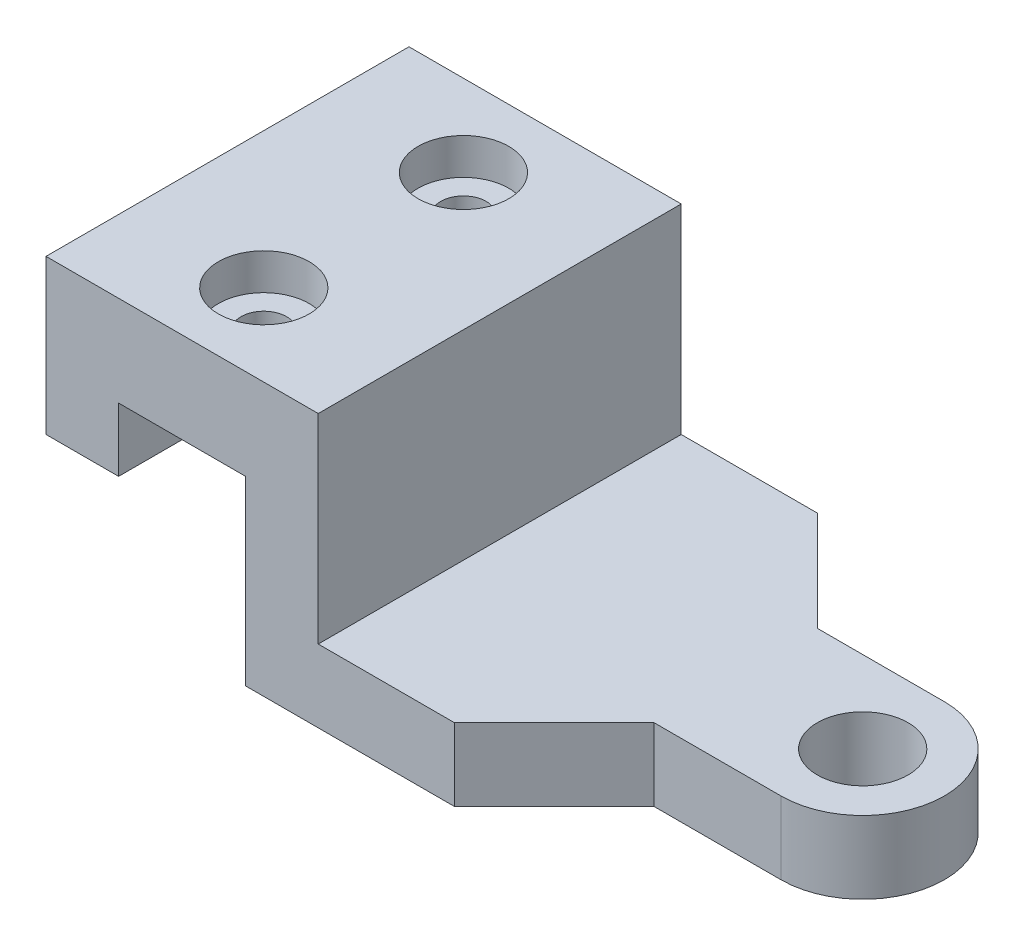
ISO-10303-21;
HEADER;
FILE_DESCRIPTION(('STEP AP214'),'2;1');
FILE_NAME('part.step','',(''),(''),'','','');
FILE_SCHEMA(('AUTOMOTIVE_DESIGN { 1 0 10303 214 1 1 1 1 }'));
ENDSEC;
DATA;
#1=APPLICATION_CONTEXT('core data for automotive mechanical design processes');
#2=APPLICATION_PROTOCOL_DEFINITION('international standard','automotive_design',2000,#1);
#3=PRODUCT_CONTEXT('',#1,'mechanical');
#4=PRODUCT('Part','Part','',(#3));
#5=PRODUCT_RELATED_PRODUCT_CATEGORY('part','',(#4));
#6=PRODUCT_DEFINITION_FORMATION('','',#4);
#7=PRODUCT_DEFINITION_CONTEXT('part definition',#1,'design');
#8=PRODUCT_DEFINITION('design','',#6,#7);
#9=PRODUCT_DEFINITION_SHAPE('','',#8);
#10=(LENGTH_UNIT() NAMED_UNIT(*) SI_UNIT(.MILLI.,.METRE.));
#11=(NAMED_UNIT(*) PLANE_ANGLE_UNIT() SI_UNIT($,.RADIAN.));
#12=(NAMED_UNIT(*) SI_UNIT($,.STERADIAN.) SOLID_ANGLE_UNIT());
#13=UNCERTAINTY_MEASURE_WITH_UNIT(LENGTH_MEASURE(1.E-05),#10,'distance_accuracy_value','');
#14=(GEOMETRIC_REPRESENTATION_CONTEXT(3) GLOBAL_UNCERTAINTY_ASSIGNED_CONTEXT((#13)) GLOBAL_UNIT_ASSIGNED_CONTEXT((#10,
#11,#12)) REPRESENTATION_CONTEXT('',''));
#15=CARTESIAN_POINT('',(0.,0.,0.));
#16=DIRECTION('',(0.,0.,1.));
#17=DIRECTION('',(1.,0.,0.));
#18=AXIS2_PLACEMENT_3D('',#15,#16,#17);
#19=CARTESIAN_POINT('',(-150.,100.,-200.));
#20=DIRECTION('',(0.,1.,0.));
#21=DIRECTION('',(0.,0.,1.));
#22=AXIS2_PLACEMENT_3D('',#19,#20,#21);
#23=PLANE('',#22);
#24=CARTESIAN_POINT('',(-75.,100.,-155.));
#25=DIRECTION('',(0.,1.,0.));
#26=DIRECTION('',(0.,0.,1.));
#27=AXIS2_PLACEMENT_3D('',#24,#25,#26);
#28=CIRCLE('',#27,12.5);
#29=CARTESIAN_POINT('',(-75.,100.,-142.5));
#30=VERTEX_POINT('',#29);
#31=EDGE_CURVE('E65',#30,#30,#28,.T.);
#32=ORIENTED_EDGE('',*,*,#31,.T.);
#33=EDGE_LOOP('',(#32));
#34=FACE_BOUND('',#33,.T.);
#35=CARTESIAN_POINT('',(-75.,100.,-45.));
#36=DIRECTION('',(0.,1.,0.));
#37=DIRECTION('',(0.,0.,1.));
#38=AXIS2_PLACEMENT_3D('',#35,#36,#37);
#39=CIRCLE('',#38,12.5);
#40=CARTESIAN_POINT('',(-75.,100.,-32.5));
#41=VERTEX_POINT('',#40);
#42=EDGE_CURVE('E171',#41,#41,#39,.T.);
#43=ORIENTED_EDGE('',*,*,#42,.T.);
#44=EDGE_LOOP('',(#43));
#45=FACE_BOUND('',#44,.T.);
#46=DIRECTION('',(0.,0.,1.));
#47=VECTOR('',#46,1.);
#48=CARTESIAN_POINT('',(-110.,100.,0.));
#49=LINE('',#48,#47);
#50=CARTESIAN_POINT('',(-110.,100.,-200.));
#51=VERTEX_POINT('',#50);
#52=CARTESIAN_POINT('',(-110.,100.,0.));
#53=VERTEX_POINT('',#52);
#54=EDGE_CURVE('E174',#51,#53,#49,.T.);
#55=ORIENTED_EDGE('',*,*,#54,.F.);
#56=DIRECTION('',(1.,0.,0.));
#57=VECTOR('',#56,1.);
#58=CARTESIAN_POINT('',(-150.,100.,-200.));
#59=LINE('',#58,#57);
#60=CARTESIAN_POINT('',(-40.,100.,-200.));
#61=VERTEX_POINT('',#60);
#62=EDGE_CURVE('E79',#51,#61,#59,.T.);
#63=ORIENTED_EDGE('',*,*,#62,.T.);
#64=DIRECTION('',(0.,0.,1.));
#65=VECTOR('',#64,1.);
#66=CARTESIAN_POINT('',(-40.,100.,-200.));
#67=LINE('',#66,#65);
#68=CARTESIAN_POINT('',(-40.,100.,0.));
#69=VERTEX_POINT('',#68);
#70=EDGE_CURVE('E221',#61,#69,#67,.T.);
#71=ORIENTED_EDGE('',*,*,#70,.T.);
#72=DIRECTION('',(1.,0.,0.));
#73=VECTOR('',#72,1.);
#74=CARTESIAN_POINT('',(-150.,100.,0.));
#75=LINE('',#74,#73);
#76=EDGE_CURVE('E234',#53,#69,#75,.T.);
#77=ORIENTED_EDGE('',*,*,#76,.F.);
#78=EDGE_LOOP('',(#55,#63,#71,#77));
#79=FACE_BOUND('',#78,.T.);
#80=ADVANCED_FACE('F61',(#34,#45,#79),#23,.F.);
#81=CARTESIAN_POINT('',(-40.,150.,0.));
#82=DIRECTION('',(1.,0.,0.));
#83=DIRECTION('',(0.,0.,-1.));
#84=AXIS2_PLACEMENT_3D('',#81,#82,#83);
#85=PLANE('',#84);
#86=ORIENTED_EDGE('',*,*,#70,.F.);
#87=DIRECTION('',(0.,-1.,0.));
#88=VECTOR('',#87,1.);
#89=CARTESIAN_POINT('',(-40.,150.,-200.));
#90=LINE('',#89,#88);
#91=CARTESIAN_POINT('',(-40.,0.,-200.));
#92=VERTEX_POINT('',#91);
#93=EDGE_CURVE('E268',#61,#92,#90,.T.);
#94=ORIENTED_EDGE('',*,*,#93,.T.);
#95=DIRECTION('',(0.,0.,1.));
#96=VECTOR('',#95,1.);
#97=CARTESIAN_POINT('',(-40.,0.,0.));
#98=LINE('',#97,#96);
#99=CARTESIAN_POINT('',(-40.,0.,0.));
#100=VERTEX_POINT('',#99);
#101=EDGE_CURVE('E242',#92,#100,#98,.T.);
#102=ORIENTED_EDGE('',*,*,#101,.T.);
#103=DIRECTION('',(0.,-1.,0.));
#104=VECTOR('',#103,1.);
#105=CARTESIAN_POINT('',(-40.,150.,0.));
#106=LINE('',#105,#104);
#107=EDGE_CURVE('E265',#69,#100,#106,.T.);
#108=ORIENTED_EDGE('',*,*,#107,.F.);
#109=EDGE_LOOP('',(#86,#94,#102,#108));
#110=FACE_BOUND('',#109,.T.);
#111=ADVANCED_FACE('F492',(#110),#85,.F.);
#112=CARTESIAN_POINT('',(200.,40.,-100.));
#113=DIRECTION('',(0.,-1.,0.));
#114=DIRECTION('',(0.,0.,-1.));
#115=AXIS2_PLACEMENT_3D('',#112,#113,#114);
#116=CYLINDRICAL_SURFACE('',#115,45.);
#117=CARTESIAN_POINT('',(200.,0.,-100.));
#118=DIRECTION('',(0.,1.,0.));
#119=DIRECTION('',(0.,0.,1.));
#120=AXIS2_PLACEMENT_3D('',#117,#118,#119);
#121=CIRCLE('',#120,45.);
#122=CARTESIAN_POINT('',(200.,0.,-145.));
#123=VERTEX_POINT('',#122);
#124=CARTESIAN_POINT('',(200.,0.,-55.));
#125=VERTEX_POINT('',#124);
#126=EDGE_CURVE('E300',#123,#125,#121,.F.);
#127=ORIENTED_EDGE('',*,*,#126,.F.);
#128=DIRECTION('',(0.,-1.,0.));
#129=VECTOR('',#128,1.);
#130=CARTESIAN_POINT('',(200.,40.,-145.));
#131=LINE('',#130,#129);
#132=CARTESIAN_POINT('',(200.,40.,-145.));
#133=VERTEX_POINT('',#132);
#134=EDGE_CURVE('E13',#133,#123,#131,.T.);
#135=ORIENTED_EDGE('',*,*,#134,.F.);
#136=CARTESIAN_POINT('',(200.,40.,-100.));
#137=DIRECTION('',(0.,1.,0.));
#138=DIRECTION('',(0.,0.,1.));
#139=AXIS2_PLACEMENT_3D('',#136,#137,#138);
#140=CIRCLE('',#139,45.);
#141=CARTESIAN_POINT('',(200.,40.,-55.));
#142=VERTEX_POINT('',#141);
#143=EDGE_CURVE('E277',#133,#142,#140,.F.);
#144=ORIENTED_EDGE('',*,*,#143,.T.);
#145=DIRECTION('',(0.,-1.,0.));
#146=VECTOR('',#145,1.);
#147=CARTESIAN_POINT('',(200.,40.,-55.));
#148=LINE('',#147,#146);
#149=EDGE_CURVE('E114',#142,#125,#148,.T.);
#150=ORIENTED_EDGE('',*,*,#149,.T.);
#151=EDGE_LOOP('',(#127,#135,#144,#150));
#152=FACE_BOUND('',#151,.T.);
#153=ADVANCED_FACE('F502',(#152),#116,.T.);
#154=CARTESIAN_POINT('',(0.,40.,-145.));
#155=DIRECTION('',(0.,0.,-1.));
#156=DIRECTION('',(-1.,0.,0.));
#157=AXIS2_PLACEMENT_3D('',#154,#155,#156);
#158=PLANE('',#157);
#159=DIRECTION('',(1.,0.,0.));
#160=VECTOR('',#159,1.);
#161=CARTESIAN_POINT('',(0.,0.,-145.));
#162=LINE('',#161,#160);
#163=CARTESIAN_POINT('',(130.,0.,-145.));
#164=VERTEX_POINT('',#163);
#165=EDGE_CURVE('E304',#164,#123,#162,.T.);
#166=ORIENTED_EDGE('',*,*,#165,.F.);
#167=DIRECTION('',(0.,-1.,0.));
#168=VECTOR('',#167,1.);
#169=CARTESIAN_POINT('',(130.,40.,-145.));
#170=LINE('',#169,#168);
#171=CARTESIAN_POINT('',(130.,40.,-145.));
#172=VERTEX_POINT('',#171);
#173=EDGE_CURVE('E71',#172,#164,#170,.T.);
#174=ORIENTED_EDGE('',*,*,#173,.F.);
#175=DIRECTION('',(1.,0.,0.));
#176=VECTOR('',#175,1.);
#177=CARTESIAN_POINT('',(0.,40.,-145.));
#178=LINE('',#177,#176);
#179=EDGE_CURVE('E281',#172,#133,#178,.T.);
#180=ORIENTED_EDGE('',*,*,#179,.T.);
#181=ORIENTED_EDGE('',*,*,#134,.T.);
#182=EDGE_LOOP('',(#166,#174,#180,#181));
#183=FACE_BOUND('',#182,.T.);
#184=ADVANCED_FACE('F501',(#183),#158,.T.);
#185=CARTESIAN_POINT('',(137.5,40.,-137.5));
#186=DIRECTION('',(0.707106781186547,0.,-0.707106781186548));
#187=DIRECTION('',(-0.707106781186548,0.,-0.707106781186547));
#188=AXIS2_PLACEMENT_3D('',#185,#186,#187);
#189=PLANE('',#188);
#190=DIRECTION('',(0.707106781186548,0.,0.707106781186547));
#191=VECTOR('',#190,1.);
#192=CARTESIAN_POINT('',(137.5,0.,-137.5));
#193=LINE('',#192,#191);
#194=CARTESIAN_POINT('',(75.,0.,-200.));
#195=VERTEX_POINT('',#194);
#196=EDGE_CURVE('E308',#195,#164,#193,.T.);
#197=ORIENTED_EDGE('',*,*,#196,.F.);
#198=DIRECTION('',(0.,-1.,0.));
#199=VECTOR('',#198,1.);
#200=CARTESIAN_POINT('',(75.,40.,-200.));
#201=LINE('',#200,#199);
#202=CARTESIAN_POINT('',(75.,40.,-200.));
#203=VERTEX_POINT('',#202);
#204=EDGE_CURVE('E160',#203,#195,#201,.T.);
#205=ORIENTED_EDGE('',*,*,#204,.F.);
#206=DIRECTION('',(0.707106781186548,0.,0.707106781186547));
#207=VECTOR('',#206,1.);
#208=CARTESIAN_POINT('',(137.5,40.,-137.5));
#209=LINE('',#208,#207);
#210=EDGE_CURVE('E285',#203,#172,#209,.T.);
#211=ORIENTED_EDGE('',*,*,#210,.T.);
#212=ORIENTED_EDGE('',*,*,#173,.T.);
#213=EDGE_LOOP('',(#197,#205,#211,#212));
#214=FACE_BOUND('',#213,.T.);
#215=ADVANCED_FACE('F497',(#214),#189,.T.);
#216=CARTESIAN_POINT('',(0.,40.,-200.));
#217=DIRECTION('',(0.,0.,-1.));
#218=DIRECTION('',(-1.,0.,0.));
#219=AXIS2_PLACEMENT_3D('',#216,#217,#218);
#220=PLANE('',#219);
#221=DIRECTION('',(1.,0.,0.));
#222=VECTOR('',#221,1.);
#223=CARTESIAN_POINT('',(0.,0.,-200.));
#224=LINE('',#223,#222);
#225=EDGE_CURVE('E312',#92,#195,#224,.T.);
#226=ORIENTED_EDGE('',*,*,#225,.F.);
#227=ORIENTED_EDGE('',*,*,#93,.F.);
#228=ORIENTED_EDGE('',*,*,#62,.F.);
#229=DIRECTION('',(0.,1.,0.));
#230=VECTOR('',#229,1.);
#231=CARTESIAN_POINT('',(-110.,65.,-200.));
#232=LINE('',#231,#230);
#233=CARTESIAN_POINT('',(-110.,65.,-200.));
#234=VERTEX_POINT('',#233);
#235=EDGE_CURVE('E217',#234,#51,#232,.T.);
#236=ORIENTED_EDGE('',*,*,#235,.F.);
#237=DIRECTION('',(1.,0.,0.));
#238=VECTOR('',#237,1.);
#239=CARTESIAN_POINT('',(-150.,65.,-200.));
#240=LINE('',#239,#238);
#241=CARTESIAN_POINT('',(-150.,65.,-200.));
#242=VERTEX_POINT('',#241);
#243=EDGE_CURVE('E201',#242,#234,#240,.T.);
#244=ORIENTED_EDGE('',*,*,#243,.F.);
#245=DIRECTION('',(0.,-1.,0.));
#246=VECTOR('',#245,1.);
#247=CARTESIAN_POINT('',(-150.,150.,-200.));
#248=LINE('',#247,#246);
#249=CARTESIAN_POINT('',(-150.,150.,-200.));
#250=VERTEX_POINT('',#249);
#251=EDGE_CURVE('E222',#250,#242,#248,.T.);
#252=ORIENTED_EDGE('',*,*,#251,.F.);
#253=DIRECTION('',(-1.,0.,0.));
#254=VECTOR('',#253,1.);
#255=CARTESIAN_POINT('',(0.,150.,-200.));
#256=LINE('',#255,#254);
#257=CARTESIAN_POINT('',(0.,150.,-200.));
#258=VERTEX_POINT('',#257);
#259=EDGE_CURVE('E243',#258,#250,#256,.T.);
#260=ORIENTED_EDGE('',*,*,#259,.F.);
#261=DIRECTION('',(0.,-1.,0.));
#262=VECTOR('',#261,1.);
#263=CARTESIAN_POINT('',(0.,150.,-200.));
#264=LINE('',#263,#262);
#265=CARTESIAN_POINT('',(0.,40.,-200.));
#266=VERTEX_POINT('',#265);
#267=EDGE_CURVE('E255',#258,#266,#264,.T.);
#268=ORIENTED_EDGE('',*,*,#267,.T.);
#269=DIRECTION('',(1.,0.,0.));
#270=VECTOR('',#269,1.);
#271=CARTESIAN_POINT('',(0.,40.,-200.));
#272=LINE('',#271,#270);
#273=EDGE_CURVE('E289',#266,#203,#272,.T.);
#274=ORIENTED_EDGE('',*,*,#273,.T.);
#275=ORIENTED_EDGE('',*,*,#204,.T.);
#276=EDGE_LOOP('',(#226,#227,#228,#236,#244,#252,#260,#268,#274,#275));
#277=FACE_BOUND('',#276,.T.);
#278=ADVANCED_FACE('F461',(#277),#220,.T.);
#279=CARTESIAN_POINT('',(0.,40.,0.));
#280=DIRECTION('',(0.,0.,-1.));
#281=DIRECTION('',(-1.,0.,0.));
#282=AXIS2_PLACEMENT_3D('',#279,#280,#281);
#283=PLANE('',#282);
#284=DIRECTION('',(1.,0.,0.));
#285=VECTOR('',#284,1.);
#286=CARTESIAN_POINT('',(0.,0.,0.));
#287=LINE('',#286,#285);
#288=CARTESIAN_POINT('',(75.,0.,0.));
#289=VERTEX_POINT('',#288);
#290=EDGE_CURVE('E158',#100,#289,#287,.T.);
#291=ORIENTED_EDGE('',*,*,#290,.T.);
#292=DIRECTION('',(0.,-1.,0.));
#293=VECTOR('',#292,1.);
#294=CARTESIAN_POINT('',(75.,40.,0.));
#295=LINE('',#294,#293);
#296=CARTESIAN_POINT('',(75.,40.,0.));
#297=VERTEX_POINT('',#296);
#298=EDGE_CURVE('E138',#297,#289,#295,.T.);
#299=ORIENTED_EDGE('',*,*,#298,.F.);
#300=DIRECTION('',(1.,0.,0.));
#301=VECTOR('',#300,1.);
#302=CARTESIAN_POINT('',(0.,40.,0.));
#303=LINE('',#302,#301);
#304=CARTESIAN_POINT('',(0.,40.,0.));
#305=VERTEX_POINT('',#304);
#306=EDGE_CURVE('E143',#305,#297,#303,.T.);
#307=ORIENTED_EDGE('',*,*,#306,.F.);
#308=DIRECTION('',(0.,-1.,0.));
#309=VECTOR('',#308,1.);
#310=CARTESIAN_POINT('',(0.,150.,0.));
#311=LINE('',#310,#309);
#312=CARTESIAN_POINT('',(0.,150.,0.));
#313=VERTEX_POINT('',#312);
#314=EDGE_CURVE('E262',#313,#305,#311,.T.);
#315=ORIENTED_EDGE('',*,*,#314,.F.);
#316=DIRECTION('',(-1.,0.,0.));
#317=VECTOR('',#316,1.);
#318=CARTESIAN_POINT('',(0.,150.,0.));
#319=LINE('',#318,#317);
#320=CARTESIAN_POINT('',(-150.,150.,0.));
#321=VERTEX_POINT('',#320);
#322=EDGE_CURVE('E247',#313,#321,#319,.T.);
#323=ORIENTED_EDGE('',*,*,#322,.T.);
#324=DIRECTION('',(0.,1.,0.));
#325=VECTOR('',#324,1.);
#326=CARTESIAN_POINT('',(-150.,150.,0.));
#327=LINE('',#326,#325);
#328=CARTESIAN_POINT('',(-150.,65.,0.));
#329=VERTEX_POINT('',#328);
#330=EDGE_CURVE('E226',#329,#321,#327,.T.);
#331=ORIENTED_EDGE('',*,*,#330,.F.);
#332=DIRECTION('',(-1.,0.,0.));
#333=VECTOR('',#332,1.);
#334=CARTESIAN_POINT('',(-150.,65.,0.));
#335=LINE('',#334,#333);
#336=CARTESIAN_POINT('',(-110.,65.,0.));
#337=VERTEX_POINT('',#336);
#338=EDGE_CURVE('E209',#337,#329,#335,.T.);
#339=ORIENTED_EDGE('',*,*,#338,.F.);
#340=DIRECTION('',(0.,1.,0.));
#341=VECTOR('',#340,1.);
#342=CARTESIAN_POINT('',(-110.,65.,0.));
#343=LINE('',#342,#341);
#344=EDGE_CURVE('E212',#337,#53,#343,.T.);
#345=ORIENTED_EDGE('',*,*,#344,.T.);
#346=ORIENTED_EDGE('',*,*,#76,.T.);
#347=ORIENTED_EDGE('',*,*,#107,.T.);
#348=EDGE_LOOP('',(#291,#299,#307,#315,#323,#331,#339,#345,#346,#347));
#349=FACE_BOUND('',#348,.T.);
#350=ADVANCED_FACE('F155',(#349),#283,.F.);
#351=CARTESIAN_POINT('',(37.5,40.,37.5));
#352=DIRECTION('',(-0.707106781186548,0.,-0.707106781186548));
#353=DIRECTION('',(-0.707106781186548,0.,0.707106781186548));
#354=AXIS2_PLACEMENT_3D('',#351,#352,#353);
#355=PLANE('',#354);
#356=DIRECTION('',(0.707106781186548,0.,-0.707106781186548));
#357=VECTOR('',#356,1.);
#358=CARTESIAN_POINT('',(37.5,0.,37.5));
#359=LINE('',#358,#357);
#360=CARTESIAN_POINT('',(130.,0.,-55.));
#361=VERTEX_POINT('',#360);
#362=EDGE_CURVE('E318',#289,#361,#359,.T.);
#363=ORIENTED_EDGE('',*,*,#362,.T.);
#364=DIRECTION('',(0.,-1.,0.));
#365=VECTOR('',#364,1.);
#366=CARTESIAN_POINT('',(130.,40.,-55.));
#367=LINE('',#366,#365);
#368=CARTESIAN_POINT('',(130.,40.,-55.));
#369=VERTEX_POINT('',#368);
#370=EDGE_CURVE('E141',#369,#361,#367,.T.);
#371=ORIENTED_EDGE('',*,*,#370,.F.);
#372=DIRECTION('',(0.707106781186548,0.,-0.707106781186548));
#373=VECTOR('',#372,1.);
#374=CARTESIAN_POINT('',(37.5,40.,37.5));
#375=LINE('',#374,#373);
#376=EDGE_CURVE('E133',#297,#369,#375,.T.);
#377=ORIENTED_EDGE('',*,*,#376,.F.);
#378=ORIENTED_EDGE('',*,*,#298,.T.);
#379=EDGE_LOOP('',(#363,#371,#377,#378));
#380=FACE_BOUND('',#379,.T.);
#381=ADVANCED_FACE('F136',(#380),#355,.F.);
#382=CARTESIAN_POINT('',(200.,40.,-100.));
#383=DIRECTION('',(0.,-1.,0.));
#384=DIRECTION('',(0.,0.,-1.));
#385=AXIS2_PLACEMENT_3D('',#382,#383,#384);
#386=CYLINDRICAL_SURFACE('',#385,25.);
#387=CARTESIAN_POINT('',(200.,40.,-100.));
#388=DIRECTION('',(0.,1.,0.));
#389=DIRECTION('',(0.,0.,1.));
#390=AXIS2_PLACEMENT_3D('',#387,#388,#389);
#391=CIRCLE('',#390,25.);
#392=CARTESIAN_POINT('',(200.,40.,-75.));
#393=VERTEX_POINT('',#392);
#394=EDGE_CURVE('E273',#393,#393,#391,.T.);
#395=ORIENTED_EDGE('',*,*,#394,.T.);
#396=EDGE_LOOP('',(#395));
#397=FACE_BOUND('',#396,.T.);
#398=CARTESIAN_POINT('',(200.,0.,-100.));
#399=DIRECTION('',(0.,1.,0.));
#400=DIRECTION('',(0.,0.,1.));
#401=AXIS2_PLACEMENT_3D('',#398,#399,#400);
#402=CIRCLE('',#401,25.);
#403=CARTESIAN_POINT('',(200.,0.,-75.));
#404=VERTEX_POINT('',#403);
#405=EDGE_CURVE('E272',#404,#404,#402,.T.);
#406=ORIENTED_EDGE('',*,*,#405,.F.);
#407=EDGE_LOOP('',(#406));
#408=FACE_BOUND('',#407,.T.);
#409=ADVANCED_FACE('F63',(#397,#408),#386,.F.);
#410=CARTESIAN_POINT('',(0.,40.,-55.));
#411=DIRECTION('',(0.,0.,-1.));
#412=DIRECTION('',(-1.,0.,0.));
#413=AXIS2_PLACEMENT_3D('',#410,#411,#412);
#414=PLANE('',#413);
#415=DIRECTION('',(1.,0.,0.));
#416=VECTOR('',#415,1.);
#417=CARTESIAN_POINT('',(0.,0.,-55.));
#418=LINE('',#417,#416);
#419=EDGE_CURVE('E278',#361,#125,#418,.T.);
#420=ORIENTED_EDGE('',*,*,#419,.T.);
#421=ORIENTED_EDGE('',*,*,#149,.F.);
#422=DIRECTION('',(1.,0.,0.));
#423=VECTOR('',#422,1.);
#424=CARTESIAN_POINT('',(0.,40.,-55.));
#425=LINE('',#424,#423);
#426=EDGE_CURVE('E88',#369,#142,#425,.T.);
#427=ORIENTED_EDGE('',*,*,#426,.F.);
#428=ORIENTED_EDGE('',*,*,#370,.T.);
#429=EDGE_LOOP('',(#420,#421,#427,#428));
#430=FACE_BOUND('',#429,.T.);
#431=ADVANCED_FACE('F504',(#430),#414,.F.);
#432=CARTESIAN_POINT('',(0.,40.,0.));
#433=DIRECTION('',(0.,1.,0.));
#434=DIRECTION('',(0.,0.,1.));
#435=AXIS2_PLACEMENT_3D('',#432,#433,#434);
#436=PLANE('',#435);
#437=ORIENTED_EDGE('',*,*,#394,.F.);
#438=EDGE_LOOP('',(#437));
#439=FACE_BOUND('',#438,.T.);
#440=ORIENTED_EDGE('',*,*,#143,.F.);
#441=ORIENTED_EDGE('',*,*,#179,.F.);
#442=ORIENTED_EDGE('',*,*,#210,.F.);
#443=ORIENTED_EDGE('',*,*,#273,.F.);
#444=DIRECTION('',(0.,0.,-1.));
#445=VECTOR('',#444,1.);
#446=CARTESIAN_POINT('',(0.,40.,0.));
#447=LINE('',#446,#445);
#448=EDGE_CURVE('E149',#305,#266,#447,.T.);
#449=ORIENTED_EDGE('',*,*,#448,.F.);
#450=ORIENTED_EDGE('',*,*,#306,.T.);
#451=ORIENTED_EDGE('',*,*,#376,.T.);
#452=ORIENTED_EDGE('',*,*,#426,.T.);
#453=EDGE_LOOP('',(#440,#441,#442,#443,#449,#450,#451,#452));
#454=FACE_BOUND('',#453,.T.);
#455=ADVANCED_FACE('F146',(#439,#454),#436,.T.);
#456=CARTESIAN_POINT('',(0.,0.,0.));
#457=DIRECTION('',(0.,1.,0.));
#458=DIRECTION('',(0.,0.,1.));
#459=AXIS2_PLACEMENT_3D('',#456,#457,#458);
#460=PLANE('',#459);
#461=ORIENTED_EDGE('',*,*,#405,.T.);
#462=EDGE_LOOP('',(#461));
#463=FACE_BOUND('',#462,.T.);
#464=ORIENTED_EDGE('',*,*,#126,.T.);
#465=ORIENTED_EDGE('',*,*,#419,.F.);
#466=ORIENTED_EDGE('',*,*,#362,.F.);
#467=ORIENTED_EDGE('',*,*,#290,.F.);
#468=ORIENTED_EDGE('',*,*,#101,.F.);
#469=ORIENTED_EDGE('',*,*,#225,.T.);
#470=ORIENTED_EDGE('',*,*,#196,.T.);
#471=ORIENTED_EDGE('',*,*,#165,.T.);
#472=EDGE_LOOP('',(#464,#465,#466,#467,#468,#469,#470,#471));
#473=FACE_BOUND('',#472,.T.);
#474=ADVANCED_FACE('F491',(#463,#473),#460,.F.);
#475=CARTESIAN_POINT('',(0.,150.,0.));
#476=DIRECTION('',(-1.,0.,0.));
#477=DIRECTION('',(0.,0.,1.));
#478=AXIS2_PLACEMENT_3D('',#475,#476,#477);
#479=PLANE('',#478);
#480=ORIENTED_EDGE('',*,*,#314,.T.);
#481=ORIENTED_EDGE('',*,*,#448,.T.);
#482=ORIENTED_EDGE('',*,*,#267,.F.);
#483=DIRECTION('',(0.,0.,-1.));
#484=VECTOR('',#483,1.);
#485=CARTESIAN_POINT('',(0.,150.,0.));
#486=LINE('',#485,#484);
#487=EDGE_CURVE('E251',#313,#258,#486,.T.);
#488=ORIENTED_EDGE('',*,*,#487,.F.);
#489=EDGE_LOOP('',(#480,#481,#482,#488));
#490=FACE_BOUND('',#489,.T.);
#491=ADVANCED_FACE('F439',(#490),#479,.F.);
#492=CARTESIAN_POINT('',(0.,150.,0.));
#493=DIRECTION('',(0.,1.,0.));
#494=DIRECTION('',(0.,0.,1.));
#495=AXIS2_PLACEMENT_3D('',#492,#493,#494);
#496=PLANE('',#495);
#497=CARTESIAN_POINT('',(-75.,150.,-155.));
#498=DIRECTION('',(0.,1.,0.));
#499=DIRECTION('',(0.,0.,1.));
#500=AXIS2_PLACEMENT_3D('',#497,#498,#499);
#501=CIRCLE('',#500,25.);
#502=CARTESIAN_POINT('',(-75.,150.,-130.));
#503=VERTEX_POINT('',#502);
#504=EDGE_CURVE('E424',#503,#503,#501,.T.);
#505=ORIENTED_EDGE('',*,*,#504,.F.);
#506=EDGE_LOOP('',(#505));
#507=FACE_BOUND('',#506,.T.);
#508=CARTESIAN_POINT('',(-75.,150.,-45.));
#509=DIRECTION('',(0.,1.,0.));
#510=DIRECTION('',(0.,0.,1.));
#511=AXIS2_PLACEMENT_3D('',#508,#509,#510);
#512=CIRCLE('',#511,25.);
#513=CARTESIAN_POINT('',(-75.,150.,-20.));
#514=VERTEX_POINT('',#513);
#515=EDGE_CURVE('E194',#514,#514,#512,.T.);
#516=ORIENTED_EDGE('',*,*,#515,.F.);
#517=EDGE_LOOP('',(#516));
#518=FACE_BOUND('',#517,.T.);
#519=ORIENTED_EDGE('',*,*,#259,.T.);
#520=DIRECTION('',(0.,0.,-1.));
#521=VECTOR('',#520,1.);
#522=CARTESIAN_POINT('',(-150.,150.,-200.));
#523=LINE('',#522,#521);
#524=EDGE_CURVE('E230',#321,#250,#523,.T.);
#525=ORIENTED_EDGE('',*,*,#524,.F.);
#526=ORIENTED_EDGE('',*,*,#322,.F.);
#527=ORIENTED_EDGE('',*,*,#487,.T.);
#528=EDGE_LOOP('',(#519,#525,#526,#527));
#529=FACE_BOUND('',#528,.T.);
#530=ADVANCED_FACE('F435',(#507,#518,#529),#496,.T.);
#531=CARTESIAN_POINT('',(-150.,0.,0.));
#532=DIRECTION('',(-1.,0.,0.));
#533=DIRECTION('',(0.,0.,1.));
#534=AXIS2_PLACEMENT_3D('',#531,#532,#533);
#535=PLANE('',#534);
#536=ORIENTED_EDGE('',*,*,#251,.T.);
#537=DIRECTION('',(0.,0.,-1.));
#538=VECTOR('',#537,1.);
#539=CARTESIAN_POINT('',(-150.,65.,0.));
#540=LINE('',#539,#538);
#541=EDGE_CURVE('E183',#329,#242,#540,.T.);
#542=ORIENTED_EDGE('',*,*,#541,.F.);
#543=ORIENTED_EDGE('',*,*,#330,.T.);
#544=ORIENTED_EDGE('',*,*,#524,.T.);
#545=EDGE_LOOP('',(#536,#542,#543,#544));
#546=FACE_BOUND('',#545,.T.);
#547=ADVANCED_FACE('F438',(#546),#535,.T.);
#548=CARTESIAN_POINT('',(-110.,65.,0.));
#549=DIRECTION('',(-1.,0.,0.));
#550=DIRECTION('',(0.,0.,1.));
#551=AXIS2_PLACEMENT_3D('',#548,#549,#550);
#552=PLANE('',#551);
#553=ORIENTED_EDGE('',*,*,#54,.T.);
#554=ORIENTED_EDGE('',*,*,#344,.F.);
#555=DIRECTION('',(0.,0.,1.));
#556=VECTOR('',#555,1.);
#557=CARTESIAN_POINT('',(-110.,65.,0.));
#558=LINE('',#557,#556);
#559=EDGE_CURVE('E205',#234,#337,#558,.T.);
#560=ORIENTED_EDGE('',*,*,#559,.F.);
#561=ORIENTED_EDGE('',*,*,#235,.T.);
#562=EDGE_LOOP('',(#553,#554,#560,#561));
#563=FACE_BOUND('',#562,.T.);
#564=ADVANCED_FACE('F524',(#563),#552,.F.);
#565=CARTESIAN_POINT('',(0.,65.,0.));
#566=DIRECTION('',(0.,-1.,0.));
#567=DIRECTION('',(0.,0.,-1.));
#568=AXIS2_PLACEMENT_3D('',#565,#566,#567);
#569=PLANE('',#568);
#570=ORIENTED_EDGE('',*,*,#541,.T.);
#571=ORIENTED_EDGE('',*,*,#243,.T.);
#572=ORIENTED_EDGE('',*,*,#559,.T.);
#573=ORIENTED_EDGE('',*,*,#338,.T.);
#574=EDGE_LOOP('',(#570,#571,#572,#573));
#575=FACE_BOUND('',#574,.T.);
#576=ADVANCED_FACE('F468',(#575),#569,.T.);
#577=CARTESIAN_POINT('',(-75.,150.,-45.));
#578=DIRECTION('',(0.,1.,0.));
#579=DIRECTION('',(0.,0.,1.));
#580=AXIS2_PLACEMENT_3D('',#577,#578,#579);
#581=CYLINDRICAL_SURFACE('',#580,12.5);
#582=CARTESIAN_POINT('',(-75.,130.,-45.));
#583=DIRECTION('',(0.,1.,0.));
#584=DIRECTION('',(0.,0.,1.));
#585=AXIS2_PLACEMENT_3D('',#582,#583,#584);
#586=CIRCLE('',#585,12.5);
#587=CARTESIAN_POINT('',(-75.,130.,-32.5));
#588=VERTEX_POINT('',#587);
#589=EDGE_CURVE('E175',#588,#588,#586,.T.);
#590=ORIENTED_EDGE('',*,*,#589,.T.);
#591=EDGE_LOOP('',(#590));
#592=FACE_BOUND('',#591,.T.);
#593=ORIENTED_EDGE('',*,*,#42,.F.);
#594=EDGE_LOOP('',(#593));
#595=FACE_BOUND('',#594,.T.);
#596=ADVANCED_FACE('F529',(#592,#595),#581,.F.);
#597=CARTESIAN_POINT('',(-62.5,130.,-45.));
#598=DIRECTION('',(0.,-1.,0.));
#599=DIRECTION('',(0.,0.,-1.));
#600=AXIS2_PLACEMENT_3D('',#597,#598,#599);
#601=PLANE('',#600);
#602=ORIENTED_EDGE('',*,*,#589,.F.);
#603=EDGE_LOOP('',(#602));
#604=FACE_BOUND('',#603,.T.);
#605=CARTESIAN_POINT('',(-75.,130.,-45.));
#606=DIRECTION('',(0.,1.,0.));
#607=DIRECTION('',(0.,0.,1.));
#608=AXIS2_PLACEMENT_3D('',#605,#606,#607);
#609=CIRCLE('',#608,25.);
#610=CARTESIAN_POINT('',(-75.,130.,-20.));
#611=VERTEX_POINT('',#610);
#612=EDGE_CURVE('E186',#611,#611,#609,.T.);
#613=ORIENTED_EDGE('',*,*,#612,.T.);
#614=EDGE_LOOP('',(#613));
#615=FACE_BOUND('',#614,.T.);
#616=ADVANCED_FACE('F532',(#604,#615),#601,.F.);
#617=CARTESIAN_POINT('',(-75.,150.,-45.));
#618=DIRECTION('',(0.,1.,0.));
#619=DIRECTION('',(0.,0.,1.));
#620=AXIS2_PLACEMENT_3D('',#617,#618,#619);
#621=CYLINDRICAL_SURFACE('',#620,25.);
#622=ORIENTED_EDGE('',*,*,#612,.F.);
#623=EDGE_LOOP('',(#622));
#624=FACE_BOUND('',#623,.T.);
#625=ORIENTED_EDGE('',*,*,#515,.T.);
#626=EDGE_LOOP('',(#625));
#627=FACE_BOUND('',#626,.T.);
#628=ADVANCED_FACE('F535',(#624,#627),#621,.F.);
#629=CARTESIAN_POINT('',(-75.,150.,-155.));
#630=DIRECTION('',(0.,1.,0.));
#631=DIRECTION('',(0.,0.,1.));
#632=AXIS2_PLACEMENT_3D('',#629,#630,#631);
#633=CYLINDRICAL_SURFACE('',#632,12.5);
#634=CARTESIAN_POINT('',(-75.,130.,-155.));
#635=DIRECTION('',(0.,1.,0.));
#636=DIRECTION('',(0.,0.,1.));
#637=AXIS2_PLACEMENT_3D('',#634,#635,#636);
#638=CIRCLE('',#637,12.5);
#639=CARTESIAN_POINT('',(-75.,130.,-142.5));
#640=VERTEX_POINT('',#639);
#641=EDGE_CURVE('E413',#640,#640,#638,.T.);
#642=ORIENTED_EDGE('',*,*,#641,.T.);
#643=EDGE_LOOP('',(#642));
#644=FACE_BOUND('',#643,.T.);
#645=ORIENTED_EDGE('',*,*,#31,.F.);
#646=EDGE_LOOP('',(#645));
#647=FACE_BOUND('',#646,.T.);
#648=ADVANCED_FACE('F539',(#644,#647),#633,.F.);
#649=CARTESIAN_POINT('',(-62.5,130.,-155.));
#650=DIRECTION('',(0.,-1.,0.));
#651=DIRECTION('',(0.,0.,-1.));
#652=AXIS2_PLACEMENT_3D('',#649,#650,#651);
#653=PLANE('',#652);
#654=ORIENTED_EDGE('',*,*,#641,.F.);
#655=EDGE_LOOP('',(#654));
#656=FACE_BOUND('',#655,.T.);
#657=CARTESIAN_POINT('',(-75.,130.,-155.));
#658=DIRECTION('',(0.,1.,0.));
#659=DIRECTION('',(0.,0.,1.));
#660=AXIS2_PLACEMENT_3D('',#657,#658,#659);
#661=CIRCLE('',#660,25.);
#662=CARTESIAN_POINT('',(-75.,130.,-130.));
#663=VERTEX_POINT('',#662);
#664=EDGE_CURVE('E418',#663,#663,#661,.T.);
#665=ORIENTED_EDGE('',*,*,#664,.T.);
#666=EDGE_LOOP('',(#665));
#667=FACE_BOUND('',#666,.T.);
#668=ADVANCED_FACE('F543',(#656,#667),#653,.F.);
#669=CARTESIAN_POINT('',(-75.,150.,-155.));
#670=DIRECTION('',(0.,1.,0.));
#671=DIRECTION('',(0.,0.,1.));
#672=AXIS2_PLACEMENT_3D('',#669,#670,#671);
#673=CYLINDRICAL_SURFACE('',#672,25.);
#674=ORIENTED_EDGE('',*,*,#664,.F.);
#675=EDGE_LOOP('',(#674));
#676=FACE_BOUND('',#675,.T.);
#677=ORIENTED_EDGE('',*,*,#504,.T.);
#678=EDGE_LOOP('',(#677));
#679=FACE_BOUND('',#678,.T.);
#680=ADVANCED_FACE('F433',(#676,#679),#673,.F.);
#681=CLOSED_SHELL('',(#80,#111,#153,#184,#215,#278,#350,#381,#409,#431,#455,#474,#491,#530,#547,
#564,#576,#596,#616,#628,#648,#668,#680));
#682=MANIFOLD_SOLID_BREP('B2',#681);
#683=ADVANCED_BREP_SHAPE_REPRESENTATION('',(#18,#682),#14);
#684=SHAPE_DEFINITION_REPRESENTATION(#9,#683);
ENDSEC;
END-ISO-10303-21;
